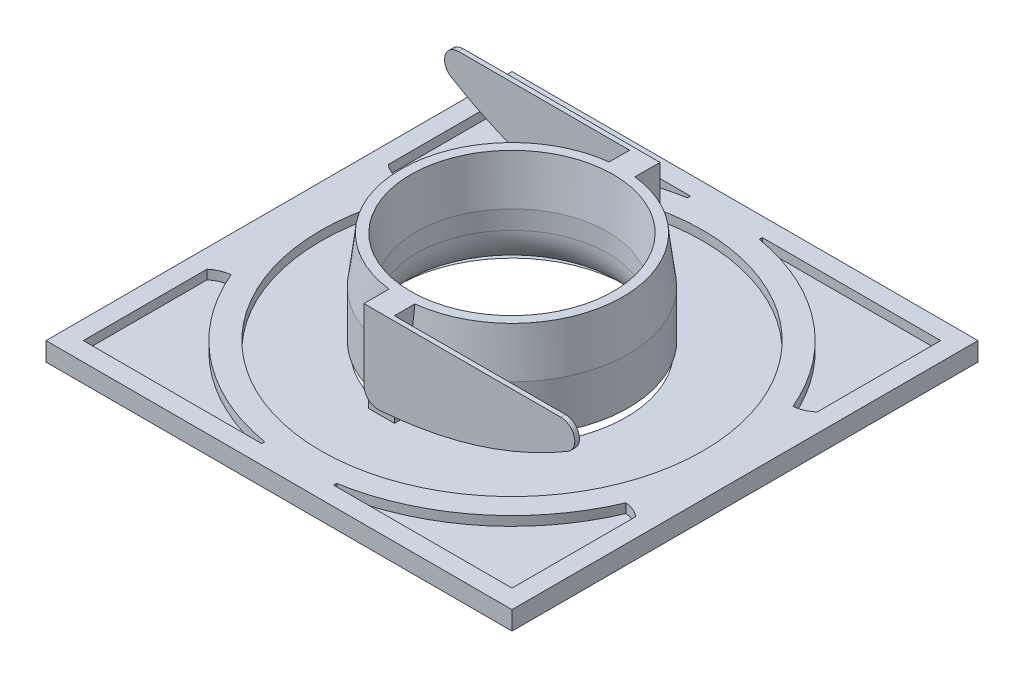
from build123d import *

# Parameters (mm, degrees)
CROQUIS1_W              = 100
CROQUIS1_H              = 100
SALIENTE_EXTRUIR1_DEPTH = 4
CROQUIS2_R              = 42.5
CROQUIS2_R_2            = 41.5
CORTAR_EXTRUIR1_DEPTH   = 2
CROQUIS3_R              = 20.5
CORTAR_EXTRUIR2_DEPTH   = 71.823724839
CROQUIS4_R              = 25
CROQUIS4_R_2            = 20.5
SALIENTE_EXTRUIR2_DEPTH = 10
CROQUIS5_R              = 25
CROQUIS5_R_2            = 20.5
SALIENTE_EXTRUIR3_DEPTH = 10
SALIENTE_EXTRUIR3_DRAFT = 7
REDONDEO1_R             = 10
SALIENTE_EXTRUIR4_REACH = 97.708
CROQUIS7_W              = 5.527559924
CROQUIS7_H              = 20
SALIENTE_EXTRUIR5_DEPTH = 1
MATRIZC1_COUNT          = 2
CROQUIS11_R             = 41
CORTAR_EXTRUIR4_DEPTH   = 2


with BuildPart() as part:
    # Croquis1 → Saliente-Extruir1 (new body)
    with BuildSketch(Plane(origin=(0, 0, 0), x_dir=(1, 0, 0), z_dir=(0, 1, 0))):
        Rectangle(CROQUIS1_W, CROQUIS1_H)
    extrude(amount=SALIENTE_EXTRUIR1_DEPTH)

    # Croquis2 → Cortar-Extruir1 (cut)
    with BuildSketch(Plane.XZ):
        with Locations(Location((0, 0, 0), (0, 0, 270))):
            Circle(CROQUIS2_R)
        with Locations(Location((0, 0, 0), (0, 0, 270))):
            Circle(CROQUIS2_R_2, mode=Mode.SUBTRACT)
    extrude(amount=-CORTAR_EXTRUIR1_DEPTH, mode=Mode.SUBTRACT)

    # Croquis3 → Cortar-Extruir2 (cut, through all)
    with BuildSketch(Plane.XZ):
        with Locations(Location((0, 0, 0), (0, 0, 270))):
            Circle(CROQUIS3_R)
    extrude(amount=-CORTAR_EXTRUIR2_DEPTH, mode=Mode.SUBTRACT)

    # Croquis4 → Saliente-Extruir2 (add)
    with BuildSketch(Plane(origin=(0, 4, 0), x_dir=(1, 0, 0), z_dir=(0, 1, 0))):
        with Locations(Location((0, 0, 0), (0, 0, 270))):
            Circle(CROQUIS4_R)
        with Locations(Location((0, 0, 0), (0, 0, 90))):
            Circle(CROQUIS4_R_2, mode=Mode.SUBTRACT)
    extrude(amount=SALIENTE_EXTRUIR2_DEPTH)


with BuildPart() as saliente_extruir3_tool:
    # Croquis5 → Saliente-Extruir3 (with draft: the straight prism first)
    with BuildSketch(Plane(origin=(0, 14, 0), x_dir=(1, 0, 0), z_dir=(0, 1, 0))):
        with Locations(Location((0, 0, 0), (0, 0, 270))):
            Circle(CROQUIS5_R)
        with Locations(Location((0, 0, 0), (0, 0, 90))):
            Circle(CROQUIS5_R_2, mode=Mode.SUBTRACT)
    extrude(amount=SALIENTE_EXTRUIR3_DEPTH)
    # Saliente-Extruir3: the draft: its side faces are tilted about the plane it starts from
    saliente_extruir3_sides = [saliente_extruir3_tool.faces().sort_by_distance(p)[0] for p in [
        (0, 19, -25),
        (0, 19, 20.5),
    ]]
    draft(saliente_extruir3_sides, Plane(origin=(0, 14, 0), x_dir=(1, 0, 0), z_dir=(0, 1, 0)), SALIENTE_EXTRUIR3_DRAFT)


with BuildPart() as part_1:
    add(part.part)

    # Saliente-Extruir3: add saliente_extruir3_tool
    add(saliente_extruir3_tool.part)

    # Redondeo1
    redondeo1_edges = [part_1.edges().sort_by_distance(p)[0] for p in [
        (0, 0, 20.5),
    ]]
    fillet(redondeo1_edges, radius=REDONDEO1_R)

    # Croquis7 → Saliente-Extruir4 (add, up to next)
    with BuildSketch(Plane.XY.offset(28), mode=Mode.PRIVATE) as saliente_extruir4_sk1:
        with Locations((0, 14)):
            Rectangle(CROQUIS7_W, CROQUIS7_H)
    saliente_extruir4_tool1 = extrude(saliente_extruir4_sk1.sketch, amount=-SALIENTE_EXTRUIR4_REACH, mode=Mode.PRIVATE) - part_1.part
    saliente_extruir4 = saliente_extruir4_tool1.solids().sort_by_distance((0, 14, 28))[0]
    add(saliente_extruir4)

    # Croquis8 → Saliente-Extruir5 (add)
    with BuildSketch(Plane.XY.offset(28)):
        with BuildLine():
            Line((-2.763779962, 24), (39.473774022, 24))
            ThreePointArc((39.473774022, 24), (42.367184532, 21.792575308), (41.002604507, 18.418783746))
            add(Edge.make_bspline(
                [(0.458531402, 5.832242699), (10.717983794, 6.59460307), (24.503119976, 9.817698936), (37.290731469, 16.220275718), (41.002604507, 18.418783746)],
                knots=[0.055671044, 0.055671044, 0.055671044, 0.055671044, 0.590546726, 0.821788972, 0.821788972, 0.821788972, 0.821788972], degree=3))
            ThreePointArc((0.458531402, 5.832242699), (-1.804988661, 6.625479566), (-2.763779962, 8.823994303))
            Line((-2.763779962, 8.823994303), (-2.763779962, 24))
        make_face()
    saliente_extruir5 = extrude(amount=SALIENTE_EXTRUIR5_DEPTH)

    # MatrizC1: Saliente-Extruir4, Saliente-Extruir5 ×2 about axis
    matrizc1_axis = Axis((0, 24, 0), (0, 1, 0))
    add([saliente_extruir4.rotate(matrizc1_axis, i * 360 / MATRIZC1_COUNT) for i in range(1, MATRIZC1_COUNT)])
    add([saliente_extruir5.rotate(matrizc1_axis, i * 360 / MATRIZC1_COUNT) for i in range(1, MATRIZC1_COUNT)])

    # Croquis11 → Cortar-Extruir4 (cut)
    with BuildSketch(Plane(origin=(0, 4, 0), x_dir=(1, 0, 0), z_dir=(0, 1, 0))):
        with Locations(Location((0, 0, 0), (0, 0, 270))):
            Circle(CROQUIS11_R)
        with BuildLine():
            Line((-7.792900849, 46), (-46, 46))
            Line((-46, 46), (-46, 19.450362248))
            ThreePointArc((-46, 19.450362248), (-44.302164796, 18.403296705), (-42.368186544, 17.914708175))
            ThreePointArc((-42.368186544, 17.914708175), (-28.583265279, 36.041600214), (-7.792900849, 45.335093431))
            ThreePointArc((-7.792900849, 45.335093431), (-7.681112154, 45.667546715), (-7.792900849, 46))
        make_face()
        with BuildLine():
            Line((46, 19.450362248), (46, 46))
            Line((46, 46), (7.792900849, 46))
            ThreePointArc((7.792900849, 46), (7.681112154, 45.667546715), (7.792900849, 45.335093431))
            ThreePointArc((7.792900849, 45.335093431), (28.583265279, 36.041600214), (42.368186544, 17.914708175))
            ThreePointArc((42.368186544, 17.914708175), (44.302164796, 18.403296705), (46, 19.450362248))
        make_face()
        with BuildLine():
            Line((46, -46), (46, -19.450362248))
            ThreePointArc((46, -19.450362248), (44.302164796, -18.403296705), (42.368186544, -17.914708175))
            ThreePointArc((42.368186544, -17.914708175), (28.583265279, -36.041600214), (7.792900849, -45.335093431))
            ThreePointArc((7.792900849, -45.335093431), (7.681112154, -45.667546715), (7.792900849, -46))
            Line((7.792900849, -46), (46, -46))
        make_face()
        with BuildLine():
            Line((-46, -46), (-7.792900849, -46))
            ThreePointArc((-7.792900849, -46), (-7.681112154, -45.667546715), (-7.792900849, -45.335093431))
            ThreePointArc((-7.792900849, -45.335093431), (-28.583265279, -36.041600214), (-42.368186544, -17.914708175))
            ThreePointArc((-42.368186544, -17.914708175), (-44.302164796, -18.403296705), (-46, -19.450362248))
            Line((-46, -19.450362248), (-46, -46))
        make_face()
    extrude(amount=-CORTAR_EXTRUIR4_DEPTH, mode=Mode.SUBTRACT)


with BuildPart() as cortar_extruir4_piece_1:
    # of the separate pieces the step leaves, piece 1, a body of its own (cortar_extruir4_pieces)
    add(part_1.part.solids().sort_by_distance((0, 0, -30.5))[0])


with BuildPart() as cortar_extruir4_piece_2:
    # of the separate pieces the step leaves, piece 2, a body of its own (cortar_extruir4_pieces)
    add(part_1.part.solids().sort_by_distance((0, 4, -22.5))[0])


solid = Compound([cortar_extruir4_piece_1.part, cortar_extruir4_piece_2.part])
